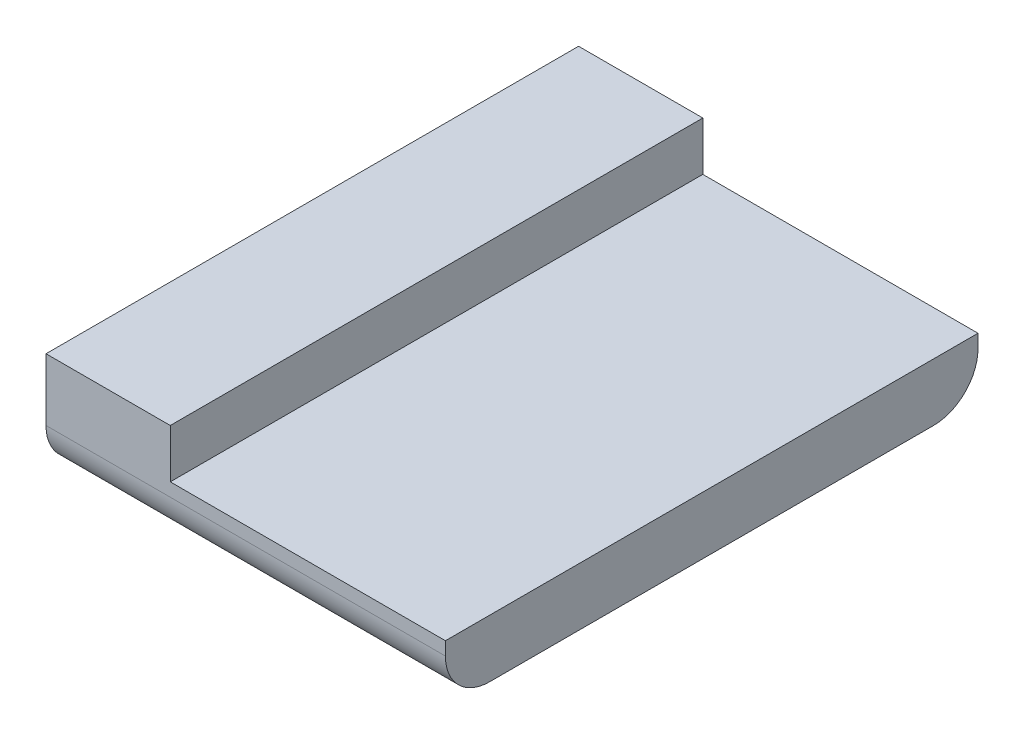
from build123d import *

# Parameters (mm, degrees)
LINEAR_AUSTRAGEN1_DEPTH = 60
VERRUNDUNG1_R           = 5


with BuildPart() as part:
    # Skizze1 → Linear austragen1 (new body)
    with BuildSketch(Plane.XY):
        Polygon((14, -5.5), (45, -5.5), (45, -12), (0, -12), (0, 0), (14, 0), align=None)
    extrude(amount=LINEAR_AUSTRAGEN1_DEPTH)

    # Verrundung1
    verrundung1_edges = [part.edges().sort_by_distance(p)[0] for p in [
        (22.5, -12, 60),
        (22.5, -12, 0),
    ]]
    fillet(verrundung1_edges, radius=VERRUNDUNG1_R)


solid = part.part
